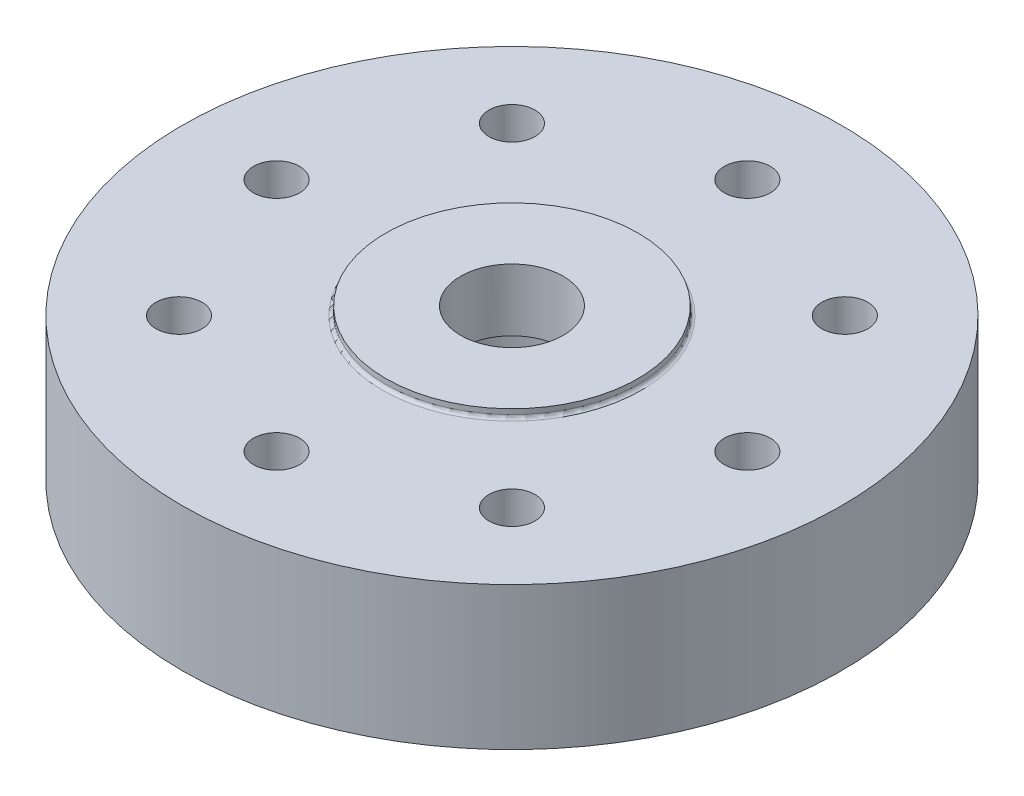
ISO-10303-21;
HEADER;
FILE_DESCRIPTION(('STEP AP214'),'2;1');
FILE_NAME('part.step','',(''),(''),'','','');
FILE_SCHEMA(('AUTOMOTIVE_DESIGN { 1 0 10303 214 1 1 1 1 }'));
ENDSEC;
DATA;
#1=APPLICATION_CONTEXT('core data for automotive mechanical design processes');
#2=APPLICATION_PROTOCOL_DEFINITION('international standard','automotive_design',2000,#1);
#3=PRODUCT_CONTEXT('',#1,'mechanical');
#4=PRODUCT('Part','Part','',(#3));
#5=PRODUCT_RELATED_PRODUCT_CATEGORY('part','',(#4));
#6=PRODUCT_DEFINITION_FORMATION('','',#4);
#7=PRODUCT_DEFINITION_CONTEXT('part definition',#1,'design');
#8=PRODUCT_DEFINITION('design','',#6,#7);
#9=PRODUCT_DEFINITION_SHAPE('','',#8);
#10=(LENGTH_UNIT() NAMED_UNIT(*) SI_UNIT(.MILLI.,.METRE.));
#11=(NAMED_UNIT(*) PLANE_ANGLE_UNIT() SI_UNIT($,.RADIAN.));
#12=(NAMED_UNIT(*) SI_UNIT($,.STERADIAN.) SOLID_ANGLE_UNIT());
#13=UNCERTAINTY_MEASURE_WITH_UNIT(LENGTH_MEASURE(1.E-05),#10,'distance_accuracy_value','');
#14=(GEOMETRIC_REPRESENTATION_CONTEXT(3) GLOBAL_UNCERTAINTY_ASSIGNED_CONTEXT((#13)) GLOBAL_UNIT_ASSIGNED_CONTEXT((#10,
#11,#12)) REPRESENTATION_CONTEXT('',''));
#15=CARTESIAN_POINT('',(0.,0.,0.));
#16=DIRECTION('',(0.,0.,1.));
#17=DIRECTION('',(1.,0.,0.));
#18=AXIS2_PLACEMENT_3D('',#15,#16,#17);
#19=CARTESIAN_POINT('',(0.,4.25,0.));
#20=DIRECTION('',(0.,1.,0.));
#21=DIRECTION('',(0.,0.,1.));
#22=AXIS2_PLACEMENT_3D('',#19,#20,#21);
#23=PLANE('',#22);
#24=CARTESIAN_POINT('',(0.,4.25,0.));
#25=DIRECTION('',(0.,1.,0.));
#26=DIRECTION('',(0.,0.,1.));
#27=AXIS2_PLACEMENT_3D('',#24,#25,#26);
#28=CIRCLE('',#27,3.85);
#29=CARTESIAN_POINT('',(0.,4.25,3.85));
#30=VERTEX_POINT('',#29);
#31=EDGE_CURVE('E11',#30,#30,#28,.F.);
#32=ORIENTED_EDGE('',*,*,#31,.T.);
#33=EDGE_LOOP('',(#32));
#34=FACE_BOUND('',#33,.T.);
#35=CARTESIAN_POINT('',(-4.94974746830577,4.25,-4.94974746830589));
#36=DIRECTION('',(0.,1.,0.));
#37=DIRECTION('',(0.,0.,1.));
#38=AXIS2_PLACEMENT_3D('',#35,#36,#37);
#39=CIRCLE('',#38,0.684999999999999);
#40=CARTESIAN_POINT('',(-4.94974746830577,4.25,-4.26474746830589));
#41=VERTEX_POINT('',#40);
#42=EDGE_CURVE('E310',#41,#41,#39,.T.);
#43=ORIENTED_EDGE('',*,*,#42,.F.);
#44=EDGE_LOOP('',(#43));
#45=FACE_BOUND('',#44,.T.);
#46=CARTESIAN_POINT('',(-4.94974746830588,4.25,4.94974746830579));
#47=DIRECTION('',(0.,1.,0.));
#48=DIRECTION('',(0.,0.,1.));
#49=AXIS2_PLACEMENT_3D('',#46,#47,#48);
#50=CIRCLE('',#49,0.685000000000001);
#51=CARTESIAN_POINT('',(-4.94974746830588,4.25,5.63474746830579));
#52=VERTEX_POINT('',#51);
#53=EDGE_CURVE('E326',#52,#52,#50,.T.);
#54=ORIENTED_EDGE('',*,*,#53,.F.);
#55=EDGE_LOOP('',(#54));
#56=FACE_BOUND('',#55,.T.);
#57=CARTESIAN_POINT('',(4.94974746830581,4.25,4.94974746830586));
#58=DIRECTION('',(0.,1.,0.));
#59=DIRECTION('',(0.,0.,1.));
#60=AXIS2_PLACEMENT_3D('',#57,#58,#59);
#61=CIRCLE('',#60,0.685);
#62=CARTESIAN_POINT('',(4.94974746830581,4.25,5.63474746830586));
#63=VERTEX_POINT('',#62);
#64=EDGE_CURVE('E342',#63,#63,#61,.T.);
#65=ORIENTED_EDGE('',*,*,#64,.F.);
#66=EDGE_LOOP('',(#65));
#67=FACE_BOUND('',#66,.T.);
#68=CARTESIAN_POINT('',(4.94974746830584,4.25,-4.94974746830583));
#69=DIRECTION('',(0.,1.,0.));
#70=DIRECTION('',(0.,0.,1.));
#71=AXIS2_PLACEMENT_3D('',#68,#69,#70);
#72=CIRCLE('',#71,0.685);
#73=CARTESIAN_POINT('',(4.94974746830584,4.25,-4.26474746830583));
#74=VERTEX_POINT('',#73);
#75=EDGE_CURVE('E358',#74,#74,#72,.T.);
#76=ORIENTED_EDGE('',*,*,#75,.F.);
#77=EDGE_LOOP('',(#76));
#78=FACE_BOUND('',#77,.T.);
#79=CARTESIAN_POINT('',(0.,4.25,-7.));
#80=DIRECTION('',(0.,1.,0.));
#81=DIRECTION('',(0.,0.,1.));
#82=AXIS2_PLACEMENT_3D('',#79,#80,#81);
#83=CIRCLE('',#82,0.685);
#84=CARTESIAN_POINT('',(0.,4.25,-6.315));
#85=VERTEX_POINT('',#84);
#86=EDGE_CURVE('E366',#85,#85,#83,.T.);
#87=ORIENTED_EDGE('',*,*,#86,.F.);
#88=EDGE_LOOP('',(#87));
#89=FACE_BOUND('',#88,.T.);
#90=CARTESIAN_POINT('',(0.,4.25,0.));
#91=DIRECTION('',(0.,1.,0.));
#92=DIRECTION('',(0.,0.,1.));
#93=AXIS2_PLACEMENT_3D('',#90,#91,#92);
#94=CIRCLE('',#93,9.8);
#95=CARTESIAN_POINT('',(0.,4.25,9.8));
#96=VERTEX_POINT('',#95);
#97=EDGE_CURVE('E374',#96,#96,#94,.T.);
#98=ORIENTED_EDGE('',*,*,#97,.T.);
#99=EDGE_LOOP('',(#98));
#100=FACE_BOUND('',#99,.T.);
#101=CARTESIAN_POINT('',(7.,4.25,0.));
#102=DIRECTION('',(0.,1.,0.));
#103=DIRECTION('',(0.,0.,1.));
#104=AXIS2_PLACEMENT_3D('',#101,#102,#103);
#105=CIRCLE('',#104,0.685);
#106=CARTESIAN_POINT('',(7.,4.25,0.685000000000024));
#107=VERTEX_POINT('',#106);
#108=EDGE_CURVE('E350',#107,#107,#105,.T.);
#109=ORIENTED_EDGE('',*,*,#108,.F.);
#110=EDGE_LOOP('',(#109));
#111=FACE_BOUND('',#110,.T.);
#112=CARTESIAN_POINT('',(0.,4.25,7.));
#113=DIRECTION('',(0.,1.,0.));
#114=DIRECTION('',(0.,0.,1.));
#115=AXIS2_PLACEMENT_3D('',#112,#113,#114);
#116=CIRCLE('',#115,0.685);
#117=CARTESIAN_POINT('',(0.,4.25,7.685));
#118=VERTEX_POINT('',#117);
#119=EDGE_CURVE('E334',#118,#118,#116,.T.);
#120=ORIENTED_EDGE('',*,*,#119,.F.);
#121=EDGE_LOOP('',(#120));
#122=FACE_BOUND('',#121,.T.);
#123=CARTESIAN_POINT('',(-7.,4.25,0.));
#124=DIRECTION('',(0.,1.,0.));
#125=DIRECTION('',(0.,0.,1.));
#126=AXIS2_PLACEMENT_3D('',#123,#124,#125);
#127=CIRCLE('',#126,0.685);
#128=CARTESIAN_POINT('',(-7.,4.25,0.684999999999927));
#129=VERTEX_POINT('',#128);
#130=EDGE_CURVE('E318',#129,#129,#127,.T.);
#131=ORIENTED_EDGE('',*,*,#130,.F.);
#132=EDGE_LOOP('',(#131));
#133=FACE_BOUND('',#132,.T.);
#134=ADVANCED_FACE('F45',(#34,#45,#56,#67,#78,#89,#100,#111,#122,#133),#23,.T.);
#135=CARTESIAN_POINT('',(0.,4.25,0.));
#136=DIRECTION('',(0.,-1.,0.));
#137=DIRECTION('',(0.,0.,-1.));
#138=AXIS2_PLACEMENT_3D('',#135,#136,#137);
#139=CYLINDRICAL_SURFACE('',#138,1.525);
#140=CARTESIAN_POINT('',(0.,2.65,0.));
#141=DIRECTION('',(0.,-1.,0.));
#142=DIRECTION('',(0.,0.,-1.));
#143=AXIS2_PLACEMENT_3D('',#140,#141,#142);
#144=CIRCLE('',#143,1.525);
#145=CARTESIAN_POINT('',(0.,2.65,-1.525));
#146=VERTEX_POINT('',#145);
#147=EDGE_CURVE('E381',#146,#146,#144,.T.);
#148=ORIENTED_EDGE('',*,*,#147,.T.);
#149=EDGE_LOOP('',(#148));
#150=FACE_BOUND('',#149,.T.);
#151=CARTESIAN_POINT('',(0.,4.5,0.));
#152=DIRECTION('',(0.,1.,0.));
#153=DIRECTION('',(0.,0.,1.));
#154=AXIS2_PLACEMENT_3D('',#151,#152,#153);
#155=CIRCLE('',#154,1.525);
#156=CARTESIAN_POINT('',(0.,4.5,1.525));
#157=VERTEX_POINT('',#156);
#158=EDGE_CURVE('E857',#157,#157,#155,.T.);
#159=ORIENTED_EDGE('',*,*,#158,.T.);
#160=EDGE_LOOP('',(#159));
#161=FACE_BOUND('',#160,.T.);
#162=ADVANCED_FACE('F402',(#150,#161),#139,.F.);
#163=CARTESIAN_POINT('',(0.,0.,0.));
#164=DIRECTION('',(0.,1.,0.));
#165=DIRECTION('',(0.,0.,1.));
#166=AXIS2_PLACEMENT_3D('',#163,#164,#165);
#167=PLANE('',#166);
#168=CARTESIAN_POINT('',(4.94974746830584,0.,-4.94974746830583));
#169=DIRECTION('',(0.,1.,0.));
#170=DIRECTION('',(0.,0.,1.));
#171=AXIS2_PLACEMENT_3D('',#168,#169,#170);
#172=CIRCLE('',#171,1.885);
#173=CARTESIAN_POINT('',(5.25146114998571,0.,-6.81044461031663));
#174=VERTEX_POINT('',#173);
#175=CARTESIAN_POINT('',(6.81044461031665,0.,-5.25146114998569));
#176=VERTEX_POINT('',#175);
#177=EDGE_CURVE('E249',#174,#176,#172,.T.);
#178=ORIENTED_EDGE('',*,*,#177,.F.);
#179=CARTESIAN_POINT('',(0.,0.,0.));
#180=DIRECTION('',(0.,1.,0.));
#181=DIRECTION('',(0.,0.,1.));
#182=AXIS2_PLACEMENT_3D('',#179,#180,#181);
#183=CIRCLE('',#182,8.6);
#184=CARTESIAN_POINT('',(1.10236777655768,0.,-8.52905535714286));
#185=VERTEX_POINT('',#184);
#186=EDGE_CURVE('E203',#174,#185,#183,.T.);
#187=ORIENTED_EDGE('',*,*,#186,.T.);
#188=CARTESIAN_POINT('',(0.,0.,-7.));
#189=DIRECTION('',(0.,1.,0.));
#190=DIRECTION('',(0.,0.,1.));
#191=AXIS2_PLACEMENT_3D('',#188,#189,#190);
#192=CIRCLE('',#191,1.885);
#193=CARTESIAN_POINT('',(-1.10236777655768,0.,-8.52905535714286));
#194=VERTEX_POINT('',#193);
#195=EDGE_CURVE('E244',#194,#185,#192,.T.);
#196=ORIENTED_EDGE('',*,*,#195,.F.);
#197=CARTESIAN_POINT('',(-5.25146114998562,0.,-6.8104446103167));
#198=VERTEX_POINT('',#197);
#199=EDGE_CURVE('E61',#194,#198,#183,.T.);
#200=ORIENTED_EDGE('',*,*,#199,.T.);
#201=CARTESIAN_POINT('',(-4.94974746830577,0.,-4.94974746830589));
#202=DIRECTION('',(0.,1.,0.));
#203=DIRECTION('',(0.,0.,1.));
#204=AXIS2_PLACEMENT_3D('',#201,#202,#203);
#205=CIRCLE('',#204,1.885);
#206=CARTESIAN_POINT('',(-6.81044461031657,0.,-5.25146114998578));
#207=VERTEX_POINT('',#206);
#208=EDGE_CURVE('E230',#207,#198,#205,.T.);
#209=ORIENTED_EDGE('',*,*,#208,.F.);
#210=CARTESIAN_POINT('',(-8.52905535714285,0.,-1.10236777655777));
#211=VERTEX_POINT('',#210);
#212=EDGE_CURVE('E897',#207,#211,#183,.T.);
#213=ORIENTED_EDGE('',*,*,#212,.T.);
#214=CARTESIAN_POINT('',(-7.,0.,0.));
#215=DIRECTION('',(0.,1.,0.));
#216=DIRECTION('',(0.,0.,1.));
#217=AXIS2_PLACEMENT_3D('',#214,#215,#216);
#218=CIRCLE('',#217,1.885);
#219=CARTESIAN_POINT('',(-8.52905535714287,0.,1.10236777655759));
#220=VERTEX_POINT('',#219);
#221=EDGE_CURVE('E180',#220,#211,#218,.T.);
#222=ORIENTED_EDGE('',*,*,#221,.F.);
#223=CARTESIAN_POINT('',(-6.81044461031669,0.,5.25146114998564));
#224=VERTEX_POINT('',#223);
#225=EDGE_CURVE('E164',#220,#224,#183,.T.);
#226=ORIENTED_EDGE('',*,*,#225,.T.);
#227=CARTESIAN_POINT('',(-4.94974746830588,0.,4.94974746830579));
#228=DIRECTION('',(0.,1.,0.));
#229=DIRECTION('',(0.,0.,1.));
#230=AXIS2_PLACEMENT_3D('',#227,#228,#229);
#231=CIRCLE('',#230,1.885);
#232=CARTESIAN_POINT('',(-5.25146114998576,0.,6.81044461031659));
#233=VERTEX_POINT('',#232);
#234=EDGE_CURVE('E179',#233,#224,#231,.T.);
#235=ORIENTED_EDGE('',*,*,#234,.F.);
#236=CARTESIAN_POINT('',(-1.10236777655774,0.,8.52905535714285));
#237=VERTEX_POINT('',#236);
#238=EDGE_CURVE('E904',#233,#237,#183,.T.);
#239=ORIENTED_EDGE('',*,*,#238,.T.);
#240=CARTESIAN_POINT('',(0.,0.,7.));
#241=DIRECTION('',(0.,1.,0.));
#242=DIRECTION('',(0.,0.,1.));
#243=AXIS2_PLACEMENT_3D('',#240,#241,#242);
#244=CIRCLE('',#243,1.885);
#245=CARTESIAN_POINT('',(1.10236777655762,0.,8.52905535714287));
#246=VERTEX_POINT('',#245);
#247=EDGE_CURVE('E264',#246,#237,#244,.T.);
#248=ORIENTED_EDGE('',*,*,#247,.F.);
#249=CARTESIAN_POINT('',(5.25146114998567,0.,6.81044461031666));
#250=VERTEX_POINT('',#249);
#251=EDGE_CURVE('E908',#246,#250,#183,.T.);
#252=ORIENTED_EDGE('',*,*,#251,.T.);
#253=CARTESIAN_POINT('',(4.94974746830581,0.,4.94974746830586));
#254=DIRECTION('',(0.,1.,0.));
#255=DIRECTION('',(0.,0.,1.));
#256=AXIS2_PLACEMENT_3D('',#253,#254,#255);
#257=CIRCLE('',#256,1.885);
#258=CARTESIAN_POINT('',(6.81044461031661,0.,5.25146114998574));
#259=VERTEX_POINT('',#258);
#260=EDGE_CURVE('E259',#259,#250,#257,.T.);
#261=ORIENTED_EDGE('',*,*,#260,.F.);
#262=CARTESIAN_POINT('',(8.52905535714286,0.,1.10236777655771));
#263=VERTEX_POINT('',#262);
#264=EDGE_CURVE('E890',#259,#263,#183,.T.);
#265=ORIENTED_EDGE('',*,*,#264,.T.);
#266=CARTESIAN_POINT('',(7.,0.,0.));
#267=DIRECTION('',(0.,1.,0.));
#268=DIRECTION('',(0.,0.,1.));
#269=AXIS2_PLACEMENT_3D('',#266,#267,#268);
#270=CIRCLE('',#269,1.885);
#271=CARTESIAN_POINT('',(8.52905535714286,0.,-1.10236777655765));
#272=VERTEX_POINT('',#271);
#273=EDGE_CURVE('E254',#272,#263,#270,.T.);
#274=ORIENTED_EDGE('',*,*,#273,.F.);
#275=EDGE_CURVE('E243',#272,#176,#183,.T.);
#276=ORIENTED_EDGE('',*,*,#275,.T.);
#277=EDGE_LOOP('',(#178,#187,#196,#200,#209,#213,#222,#226,#235,#239,#248,#252,#261,#265,#274,#276));
#278=FACE_BOUND('',#277,.T.);
#279=CARTESIAN_POINT('',(0.,0.,0.));
#280=DIRECTION('',(0.,1.,0.));
#281=DIRECTION('',(0.,0.,1.));
#282=AXIS2_PLACEMENT_3D('',#279,#280,#281);
#283=CIRCLE('',#282,9.8);
#284=CARTESIAN_POINT('',(0.,0.,9.8));
#285=VERTEX_POINT('',#284);
#286=EDGE_CURVE('E370',#285,#285,#283,.T.);
#287=ORIENTED_EDGE('',*,*,#286,.F.);
#288=EDGE_LOOP('',(#287));
#289=FACE_BOUND('',#288,.T.);
#290=CARTESIAN_POINT('',(0.,0.,-7.));
#291=DIRECTION('',(0.,1.,0.));
#292=DIRECTION('',(0.,0.,1.));
#293=AXIS2_PLACEMENT_3D('',#290,#291,#292);
#294=CIRCLE('',#293,0.685);
#295=CARTESIAN_POINT('',(0.,0.,-6.315));
#296=VERTEX_POINT('',#295);
#297=EDGE_CURVE('E362',#296,#296,#294,.T.);
#298=ORIENTED_EDGE('',*,*,#297,.T.);
#299=EDGE_LOOP('',(#298));
#300=FACE_BOUND('',#299,.T.);
#301=CARTESIAN_POINT('',(4.94974746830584,0.,-4.94974746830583));
#302=DIRECTION('',(0.,1.,0.));
#303=DIRECTION('',(0.,0.,1.));
#304=AXIS2_PLACEMENT_3D('',#301,#302,#303);
#305=CIRCLE('',#304,0.685);
#306=CARTESIAN_POINT('',(4.94974746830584,0.,-4.26474746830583));
#307=VERTEX_POINT('',#306);
#308=EDGE_CURVE('E354',#307,#307,#305,.T.);
#309=ORIENTED_EDGE('',*,*,#308,.T.);
#310=EDGE_LOOP('',(#309));
#311=FACE_BOUND('',#310,.T.);
#312=CARTESIAN_POINT('',(7.,0.,0.));
#313=DIRECTION('',(0.,1.,0.));
#314=DIRECTION('',(0.,0.,1.));
#315=AXIS2_PLACEMENT_3D('',#312,#313,#314);
#316=CIRCLE('',#315,0.685);
#317=CARTESIAN_POINT('',(7.,0.,0.685000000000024));
#318=VERTEX_POINT('',#317);
#319=EDGE_CURVE('E346',#318,#318,#316,.T.);
#320=ORIENTED_EDGE('',*,*,#319,.T.);
#321=EDGE_LOOP('',(#320));
#322=FACE_BOUND('',#321,.T.);
#323=CARTESIAN_POINT('',(4.94974746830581,0.,4.94974746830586));
#324=DIRECTION('',(0.,1.,0.));
#325=DIRECTION('',(0.,0.,1.));
#326=AXIS2_PLACEMENT_3D('',#323,#324,#325);
#327=CIRCLE('',#326,0.685);
#328=CARTESIAN_POINT('',(4.94974746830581,0.,5.63474746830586));
#329=VERTEX_POINT('',#328);
#330=EDGE_CURVE('E338',#329,#329,#327,.T.);
#331=ORIENTED_EDGE('',*,*,#330,.T.);
#332=EDGE_LOOP('',(#331));
#333=FACE_BOUND('',#332,.T.);
#334=CARTESIAN_POINT('',(0.,0.,7.));
#335=DIRECTION('',(0.,1.,0.));
#336=DIRECTION('',(0.,0.,1.));
#337=AXIS2_PLACEMENT_3D('',#334,#335,#336);
#338=CIRCLE('',#337,0.685);
#339=CARTESIAN_POINT('',(0.,0.,7.685));
#340=VERTEX_POINT('',#339);
#341=EDGE_CURVE('E330',#340,#340,#338,.T.);
#342=ORIENTED_EDGE('',*,*,#341,.T.);
#343=EDGE_LOOP('',(#342));
#344=FACE_BOUND('',#343,.T.);
#345=CARTESIAN_POINT('',(-4.94974746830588,0.,4.94974746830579));
#346=DIRECTION('',(0.,1.,0.));
#347=DIRECTION('',(0.,0.,1.));
#348=AXIS2_PLACEMENT_3D('',#345,#346,#347);
#349=CIRCLE('',#348,0.685000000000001);
#350=CARTESIAN_POINT('',(-4.94974746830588,0.,5.63474746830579));
#351=VERTEX_POINT('',#350);
#352=EDGE_CURVE('E322',#351,#351,#349,.T.);
#353=ORIENTED_EDGE('',*,*,#352,.T.);
#354=EDGE_LOOP('',(#353));
#355=FACE_BOUND('',#354,.T.);
#356=CARTESIAN_POINT('',(-7.,0.,0.));
#357=DIRECTION('',(0.,1.,0.));
#358=DIRECTION('',(0.,0.,1.));
#359=AXIS2_PLACEMENT_3D('',#356,#357,#358);
#360=CIRCLE('',#359,0.685);
#361=CARTESIAN_POINT('',(-7.,0.,0.684999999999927));
#362=VERTEX_POINT('',#361);
#363=EDGE_CURVE('E314',#362,#362,#360,.T.);
#364=ORIENTED_EDGE('',*,*,#363,.T.);
#365=EDGE_LOOP('',(#364));
#366=FACE_BOUND('',#365,.T.);
#367=CARTESIAN_POINT('',(-4.94974746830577,0.,-4.94974746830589));
#368=DIRECTION('',(0.,1.,0.));
#369=DIRECTION('',(0.,0.,1.));
#370=AXIS2_PLACEMENT_3D('',#367,#368,#369);
#371=CIRCLE('',#370,0.684999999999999);
#372=CARTESIAN_POINT('',(-4.94974746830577,0.,-4.26474746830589));
#373=VERTEX_POINT('',#372);
#374=EDGE_CURVE('E309',#373,#373,#371,.T.);
#375=ORIENTED_EDGE('',*,*,#374,.T.);
#376=EDGE_LOOP('',(#375));
#377=FACE_BOUND('',#376,.T.);
#378=ADVANCED_FACE('F408',(#278,#289,#300,#311,#322,#333,#344,#355,#366,#377),#167,.F.);
#379=CARTESIAN_POINT('',(0.,4.25,0.));
#380=DIRECTION('',(0.,-1.,0.));
#381=DIRECTION('',(0.,0.,-1.));
#382=AXIS2_PLACEMENT_3D('',#379,#380,#381);
#383=CYLINDRICAL_SURFACE('',#382,9.8);
#384=ORIENTED_EDGE('',*,*,#97,.F.);
#385=EDGE_LOOP('',(#384));
#386=FACE_BOUND('',#385,.T.);
#387=ORIENTED_EDGE('',*,*,#286,.T.);
#388=EDGE_LOOP('',(#387));
#389=FACE_BOUND('',#388,.T.);
#390=ADVANCED_FACE('F416',(#386,#389),#383,.T.);
#391=CARTESIAN_POINT('',(0.,4.25,-7.));
#392=DIRECTION('',(0.,-1.,0.));
#393=DIRECTION('',(0.,0.,-1.));
#394=AXIS2_PLACEMENT_3D('',#391,#392,#393);
#395=CYLINDRICAL_SURFACE('',#394,0.685);
#396=ORIENTED_EDGE('',*,*,#86,.T.);
#397=EDGE_LOOP('',(#396));
#398=FACE_BOUND('',#397,.T.);
#399=ORIENTED_EDGE('',*,*,#297,.F.);
#400=EDGE_LOOP('',(#399));
#401=FACE_BOUND('',#400,.T.);
#402=ADVANCED_FACE('F414',(#398,#401),#395,.F.);
#403=CARTESIAN_POINT('',(4.94974746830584,4.25,-4.94974746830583));
#404=DIRECTION('',(0.,-1.,0.));
#405=DIRECTION('',(0.,0.,-1.));
#406=AXIS2_PLACEMENT_3D('',#403,#404,#405);
#407=CYLINDRICAL_SURFACE('',#406,0.685);
#408=ORIENTED_EDGE('',*,*,#75,.T.);
#409=EDGE_LOOP('',(#408));
#410=FACE_BOUND('',#409,.T.);
#411=ORIENTED_EDGE('',*,*,#308,.F.);
#412=EDGE_LOOP('',(#411));
#413=FACE_BOUND('',#412,.T.);
#414=ADVANCED_FACE('F423',(#410,#413),#407,.F.);
#415=CARTESIAN_POINT('',(7.,4.25,0.));
#416=DIRECTION('',(0.,-1.,0.));
#417=DIRECTION('',(0.,0.,-1.));
#418=AXIS2_PLACEMENT_3D('',#415,#416,#417);
#419=CYLINDRICAL_SURFACE('',#418,0.685);
#420=ORIENTED_EDGE('',*,*,#108,.T.);
#421=EDGE_LOOP('',(#420));
#422=FACE_BOUND('',#421,.T.);
#423=ORIENTED_EDGE('',*,*,#319,.F.);
#424=EDGE_LOOP('',(#423));
#425=FACE_BOUND('',#424,.T.);
#426=ADVANCED_FACE('F476',(#422,#425),#419,.F.);
#427=CARTESIAN_POINT('',(4.94974746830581,4.25,4.94974746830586));
#428=DIRECTION('',(0.,-1.,0.));
#429=DIRECTION('',(0.,0.,-1.));
#430=AXIS2_PLACEMENT_3D('',#427,#428,#429);
#431=CYLINDRICAL_SURFACE('',#430,0.685);
#432=ORIENTED_EDGE('',*,*,#64,.T.);
#433=EDGE_LOOP('',(#432));
#434=FACE_BOUND('',#433,.T.);
#435=ORIENTED_EDGE('',*,*,#330,.F.);
#436=EDGE_LOOP('',(#435));
#437=FACE_BOUND('',#436,.T.);
#438=ADVANCED_FACE('F472',(#434,#437),#431,.F.);
#439=CARTESIAN_POINT('',(0.,4.25,7.));
#440=DIRECTION('',(0.,-1.,0.));
#441=DIRECTION('',(0.,0.,-1.));
#442=AXIS2_PLACEMENT_3D('',#439,#440,#441);
#443=CYLINDRICAL_SURFACE('',#442,0.685);
#444=ORIENTED_EDGE('',*,*,#119,.T.);
#445=EDGE_LOOP('',(#444));
#446=FACE_BOUND('',#445,.T.);
#447=ORIENTED_EDGE('',*,*,#341,.F.);
#448=EDGE_LOOP('',(#447));
#449=FACE_BOUND('',#448,.T.);
#450=ADVANCED_FACE('F468',(#446,#449),#443,.F.);
#451=CARTESIAN_POINT('',(-4.94974746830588,4.25,4.94974746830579));
#452=DIRECTION('',(0.,-1.,0.));
#453=DIRECTION('',(0.,0.,-1.));
#454=AXIS2_PLACEMENT_3D('',#451,#452,#453);
#455=CYLINDRICAL_SURFACE('',#454,0.685000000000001);
#456=ORIENTED_EDGE('',*,*,#53,.T.);
#457=EDGE_LOOP('',(#456));
#458=FACE_BOUND('',#457,.T.);
#459=ORIENTED_EDGE('',*,*,#352,.F.);
#460=EDGE_LOOP('',(#459));
#461=FACE_BOUND('',#460,.T.);
#462=ADVANCED_FACE('F459',(#458,#461),#455,.F.);
#463=CARTESIAN_POINT('',(-7.,4.25,0.));
#464=DIRECTION('',(0.,-1.,0.));
#465=DIRECTION('',(0.,0.,-1.));
#466=AXIS2_PLACEMENT_3D('',#463,#464,#465);
#467=CYLINDRICAL_SURFACE('',#466,0.685);
#468=ORIENTED_EDGE('',*,*,#130,.T.);
#469=EDGE_LOOP('',(#468));
#470=FACE_BOUND('',#469,.T.);
#471=ORIENTED_EDGE('',*,*,#363,.F.);
#472=EDGE_LOOP('',(#471));
#473=FACE_BOUND('',#472,.T.);
#474=ADVANCED_FACE('F449',(#470,#473),#467,.F.);
#475=CARTESIAN_POINT('',(-4.94974746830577,4.25,-4.94974746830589));
#476=DIRECTION('',(0.,-1.,0.));
#477=DIRECTION('',(0.,0.,-1.));
#478=AXIS2_PLACEMENT_3D('',#475,#476,#477);
#479=CYLINDRICAL_SURFACE('',#478,0.684999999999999);
#480=ORIENTED_EDGE('',*,*,#42,.T.);
#481=EDGE_LOOP('',(#480));
#482=FACE_BOUND('',#481,.T.);
#483=ORIENTED_EDGE('',*,*,#374,.F.);
#484=EDGE_LOOP('',(#483));
#485=FACE_BOUND('',#484,.T.);
#486=ADVANCED_FACE('F446',(#482,#485),#479,.F.);
#487=CARTESIAN_POINT('',(0.,4.25,0.));
#488=DIRECTION('',(0.,-1.,0.));
#489=DIRECTION('',(0.,0.,-1.));
#490=AXIS2_PLACEMENT_3D('',#487,#488,#489);
#491=CYLINDRICAL_SURFACE('',#490,8.6);
#492=DIRECTION('',(0.,-1.,0.));
#493=VECTOR('',#492,1.);
#494=CARTESIAN_POINT('',(1.10236777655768,4.25,-8.52905535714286));
#495=LINE('',#494,#493);
#496=CARTESIAN_POINT('',(1.10236777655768,3.05,-8.52905535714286));
#497=VERTEX_POINT('',#496);
#498=EDGE_CURVE('E306',#497,#185,#495,.T.);
#499=ORIENTED_EDGE('',*,*,#498,.T.);
#500=ORIENTED_EDGE('',*,*,#186,.F.);
#501=DIRECTION('',(0.,-1.,0.));
#502=VECTOR('',#501,1.);
#503=CARTESIAN_POINT('',(5.25146114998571,4.25,-6.81044461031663));
#504=LINE('',#503,#502);
#505=CARTESIAN_POINT('',(5.25146114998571,3.05,-6.81044461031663));
#506=VERTEX_POINT('',#505);
#507=EDGE_CURVE('E301',#506,#174,#504,.T.);
#508=ORIENTED_EDGE('',*,*,#507,.F.);
#509=CARTESIAN_POINT('',(0.,3.05,0.));
#510=DIRECTION('',(0.,1.,0.));
#511=DIRECTION('',(0.,0.,1.));
#512=AXIS2_PLACEMENT_3D('',#509,#510,#511);
#513=CIRCLE('',#512,8.6);
#514=EDGE_CURVE('E211',#506,#497,#513,.T.);
#515=ORIENTED_EDGE('',*,*,#514,.T.);
#516=EDGE_LOOP('',(#499,#500,#508,#515));
#517=FACE_BOUND('',#516,.T.);
#518=ADVANCED_FACE('F448',(#517),#491,.F.);
#519=CARTESIAN_POINT('',(-1.10236777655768,3.05,-8.52905535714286));
#520=VERTEX_POINT('',#519);
#521=CARTESIAN_POINT('',(-5.25146114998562,3.05,-6.8104446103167));
#522=VERTEX_POINT('',#521);
#523=EDGE_CURVE('E202',#520,#522,#513,.T.);
#524=ORIENTED_EDGE('',*,*,#523,.T.);
#525=DIRECTION('',(0.,-1.,0.));
#526=VECTOR('',#525,1.);
#527=CARTESIAN_POINT('',(-5.25146114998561,4.25,-6.8104446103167));
#528=LINE('',#527,#526);
#529=EDGE_CURVE('E66',#522,#198,#528,.T.);
#530=ORIENTED_EDGE('',*,*,#529,.T.);
#531=ORIENTED_EDGE('',*,*,#199,.F.);
#532=DIRECTION('',(0.,-1.,0.));
#533=VECTOR('',#532,1.);
#534=CARTESIAN_POINT('',(-1.10236777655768,4.25,-8.52905535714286));
#535=LINE('',#534,#533);
#536=EDGE_CURVE('E220',#520,#194,#535,.T.);
#537=ORIENTED_EDGE('',*,*,#536,.F.);
#538=EDGE_LOOP('',(#524,#530,#531,#537));
#539=FACE_BOUND('',#538,.T.);
#540=ADVANCED_FACE('F219',(#539),#491,.F.);
#541=DIRECTION('',(0.,-1.,0.));
#542=VECTOR('',#541,1.);
#543=CARTESIAN_POINT('',(6.81044461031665,4.25,-5.25146114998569));
#544=LINE('',#543,#542);
#545=CARTESIAN_POINT('',(6.81044461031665,3.05,-5.25146114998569));
#546=VERTEX_POINT('',#545);
#547=EDGE_CURVE('E298',#546,#176,#544,.T.);
#548=ORIENTED_EDGE('',*,*,#547,.T.);
#549=ORIENTED_EDGE('',*,*,#275,.F.);
#550=DIRECTION('',(0.,-1.,0.));
#551=VECTOR('',#550,1.);
#552=CARTESIAN_POINT('',(8.52905535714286,4.25,-1.10236777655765));
#553=LINE('',#552,#551);
#554=CARTESIAN_POINT('',(8.52905535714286,3.05,-1.10236777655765));
#555=VERTEX_POINT('',#554);
#556=EDGE_CURVE('E295',#555,#272,#553,.T.);
#557=ORIENTED_EDGE('',*,*,#556,.F.);
#558=EDGE_CURVE('E206',#555,#546,#513,.T.);
#559=ORIENTED_EDGE('',*,*,#558,.T.);
#560=EDGE_LOOP('',(#548,#549,#557,#559));
#561=FACE_BOUND('',#560,.T.);
#562=ADVANCED_FACE('F555',(#561),#491,.F.);
#563=DIRECTION('',(0.,-1.,0.));
#564=VECTOR('',#563,1.);
#565=CARTESIAN_POINT('',(8.52905535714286,4.25,1.10236777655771));
#566=LINE('',#565,#564);
#567=CARTESIAN_POINT('',(8.52905535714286,3.05,1.10236777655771));
#568=VERTEX_POINT('',#567);
#569=EDGE_CURVE('E292',#568,#263,#566,.T.);
#570=ORIENTED_EDGE('',*,*,#569,.T.);
#571=ORIENTED_EDGE('',*,*,#264,.F.);
#572=DIRECTION('',(0.,-1.,0.));
#573=VECTOR('',#572,1.);
#574=CARTESIAN_POINT('',(6.81044461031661,4.25,5.25146114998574));
#575=LINE('',#574,#573);
#576=CARTESIAN_POINT('',(6.81044461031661,3.05,5.25146114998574));
#577=VERTEX_POINT('',#576);
#578=EDGE_CURVE('E289',#577,#259,#575,.T.);
#579=ORIENTED_EDGE('',*,*,#578,.F.);
#580=EDGE_CURVE('E198',#577,#568,#513,.T.);
#581=ORIENTED_EDGE('',*,*,#580,.T.);
#582=EDGE_LOOP('',(#570,#571,#579,#581));
#583=FACE_BOUND('',#582,.T.);
#584=ADVANCED_FACE('F564',(#583),#491,.F.);
#585=DIRECTION('',(0.,-1.,0.));
#586=VECTOR('',#585,1.);
#587=CARTESIAN_POINT('',(5.25146114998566,4.25,6.81044461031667));
#588=LINE('',#587,#586);
#589=CARTESIAN_POINT('',(5.25146114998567,3.05,6.81044461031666));
#590=VERTEX_POINT('',#589);
#591=EDGE_CURVE('E286',#590,#250,#588,.T.);
#592=ORIENTED_EDGE('',*,*,#591,.T.);
#593=ORIENTED_EDGE('',*,*,#251,.F.);
#594=DIRECTION('',(0.,-1.,0.));
#595=VECTOR('',#594,1.);
#596=CARTESIAN_POINT('',(1.10236777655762,4.25,8.52905535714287));
#597=LINE('',#596,#595);
#598=CARTESIAN_POINT('',(1.10236777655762,3.05,8.52905535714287));
#599=VERTEX_POINT('',#598);
#600=EDGE_CURVE('E283',#599,#246,#597,.T.);
#601=ORIENTED_EDGE('',*,*,#600,.F.);
#602=EDGE_CURVE('E192',#599,#590,#513,.T.);
#603=ORIENTED_EDGE('',*,*,#602,.T.);
#604=EDGE_LOOP('',(#592,#593,#601,#603));
#605=FACE_BOUND('',#604,.T.);
#606=ADVANCED_FACE('F573',(#605),#491,.F.);
#607=DIRECTION('',(0.,-1.,0.));
#608=VECTOR('',#607,1.);
#609=CARTESIAN_POINT('',(-1.10236777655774,4.25,8.52905535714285));
#610=LINE('',#609,#608);
#611=CARTESIAN_POINT('',(-1.10236777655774,3.05,8.52905535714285));
#612=VERTEX_POINT('',#611);
#613=EDGE_CURVE('E280',#612,#237,#610,.T.);
#614=ORIENTED_EDGE('',*,*,#613,.T.);
#615=ORIENTED_EDGE('',*,*,#238,.F.);
#616=DIRECTION('',(0.,-1.,0.));
#617=VECTOR('',#616,1.);
#618=CARTESIAN_POINT('',(-5.25146114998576,4.25,6.8104446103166));
#619=LINE('',#618,#617);
#620=CARTESIAN_POINT('',(-5.25146114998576,3.05,6.81044461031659));
#621=VERTEX_POINT('',#620);
#622=EDGE_CURVE('E277',#621,#233,#619,.T.);
#623=ORIENTED_EDGE('',*,*,#622,.F.);
#624=EDGE_CURVE('E189',#621,#612,#513,.T.);
#625=ORIENTED_EDGE('',*,*,#624,.T.);
#626=EDGE_LOOP('',(#614,#615,#623,#625));
#627=FACE_BOUND('',#626,.T.);
#628=ADVANCED_FACE('F583',(#627),#491,.F.);
#629=DIRECTION('',(0.,-1.,0.));
#630=VECTOR('',#629,1.);
#631=CARTESIAN_POINT('',(-6.81044461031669,4.25,5.25146114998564));
#632=LINE('',#631,#630);
#633=CARTESIAN_POINT('',(-6.81044461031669,3.05,5.25146114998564));
#634=VERTEX_POINT('',#633);
#635=EDGE_CURVE('E169',#634,#224,#632,.T.);
#636=ORIENTED_EDGE('',*,*,#635,.T.);
#637=ORIENTED_EDGE('',*,*,#225,.F.);
#638=DIRECTION('',(0.,-1.,0.));
#639=VECTOR('',#638,1.);
#640=CARTESIAN_POINT('',(-8.52905535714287,4.25,1.10236777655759));
#641=LINE('',#640,#639);
#642=CARTESIAN_POINT('',(-8.52905535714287,3.05,1.10236777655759));
#643=VERTEX_POINT('',#642);
#644=EDGE_CURVE('E158',#643,#220,#641,.T.);
#645=ORIENTED_EDGE('',*,*,#644,.F.);
#646=EDGE_CURVE('E162',#643,#634,#513,.T.);
#647=ORIENTED_EDGE('',*,*,#646,.T.);
#648=EDGE_LOOP('',(#636,#637,#645,#647));
#649=FACE_BOUND('',#648,.T.);
#650=ADVANCED_FACE('F160',(#649),#491,.F.);
#651=CARTESIAN_POINT('',(0.,3.05,0.));
#652=DIRECTION('',(0.,1.,0.));
#653=DIRECTION('',(0.,0.,1.));
#654=AXIS2_PLACEMENT_3D('',#651,#652,#653);
#655=PLANE('',#654);
#656=CARTESIAN_POINT('',(0.,3.05,0.));
#657=DIRECTION('',(0.,1.,0.));
#658=DIRECTION('',(0.,0.,1.));
#659=AXIS2_PLACEMENT_3D('',#656,#657,#658);
#660=CIRCLE('',#659,4.4);
#661=CARTESIAN_POINT('',(0.,3.05,-4.4));
#662=VERTEX_POINT('',#661);
#663=EDGE_CURVE('E235',#662,#662,#660,.F.);
#664=ORIENTED_EDGE('',*,*,#663,.F.);
#665=EDGE_LOOP('',(#664));
#666=FACE_BOUND('',#665,.T.);
#667=ORIENTED_EDGE('',*,*,#523,.F.);
#668=CARTESIAN_POINT('',(0.,3.05,-7.));
#669=DIRECTION('',(0.,1.,0.));
#670=DIRECTION('',(0.,0.,1.));
#671=AXIS2_PLACEMENT_3D('',#668,#669,#670);
#672=CIRCLE('',#671,1.885);
#673=EDGE_CURVE('E225',#520,#497,#672,.T.);
#674=ORIENTED_EDGE('',*,*,#673,.T.);
#675=ORIENTED_EDGE('',*,*,#514,.F.);
#676=CARTESIAN_POINT('',(4.94974746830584,3.05,-4.94974746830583));
#677=DIRECTION('',(0.,1.,0.));
#678=DIRECTION('',(0.,0.,1.));
#679=AXIS2_PLACEMENT_3D('',#676,#677,#678);
#680=CIRCLE('',#679,1.885);
#681=EDGE_CURVE('E248',#506,#546,#680,.T.);
#682=ORIENTED_EDGE('',*,*,#681,.T.);
#683=ORIENTED_EDGE('',*,*,#558,.F.);
#684=CARTESIAN_POINT('',(7.,3.05,0.));
#685=DIRECTION('',(0.,1.,0.));
#686=DIRECTION('',(0.,0.,1.));
#687=AXIS2_PLACEMENT_3D('',#684,#685,#686);
#688=CIRCLE('',#687,1.885);
#689=EDGE_CURVE('E253',#555,#568,#688,.T.);
#690=ORIENTED_EDGE('',*,*,#689,.T.);
#691=ORIENTED_EDGE('',*,*,#580,.F.);
#692=CARTESIAN_POINT('',(4.94974746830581,3.05,4.94974746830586));
#693=DIRECTION('',(0.,1.,0.));
#694=DIRECTION('',(0.,0.,1.));
#695=AXIS2_PLACEMENT_3D('',#692,#693,#694);
#696=CIRCLE('',#695,1.885);
#697=EDGE_CURVE('E258',#577,#590,#696,.T.);
#698=ORIENTED_EDGE('',*,*,#697,.T.);
#699=ORIENTED_EDGE('',*,*,#602,.F.);
#700=CARTESIAN_POINT('',(0.,3.05,7.));
#701=DIRECTION('',(0.,1.,0.));
#702=DIRECTION('',(0.,0.,1.));
#703=AXIS2_PLACEMENT_3D('',#700,#701,#702);
#704=CIRCLE('',#703,1.885);
#705=EDGE_CURVE('E263',#599,#612,#704,.T.);
#706=ORIENTED_EDGE('',*,*,#705,.T.);
#707=ORIENTED_EDGE('',*,*,#624,.F.);
#708=CARTESIAN_POINT('',(-4.94974746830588,3.05,4.94974746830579));
#709=DIRECTION('',(0.,1.,0.));
#710=DIRECTION('',(0.,0.,1.));
#711=AXIS2_PLACEMENT_3D('',#708,#709,#710);
#712=CIRCLE('',#711,1.885);
#713=EDGE_CURVE('E187',#621,#634,#712,.T.);
#714=ORIENTED_EDGE('',*,*,#713,.T.);
#715=ORIENTED_EDGE('',*,*,#646,.F.);
#716=CARTESIAN_POINT('',(-7.,3.05,0.));
#717=DIRECTION('',(0.,1.,0.));
#718=DIRECTION('',(0.,0.,1.));
#719=AXIS2_PLACEMENT_3D('',#716,#717,#718);
#720=CIRCLE('',#719,1.885);
#721=CARTESIAN_POINT('',(-8.52905535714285,3.05,-1.10236777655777));
#722=VERTEX_POINT('',#721);
#723=EDGE_CURVE('E173',#643,#722,#720,.T.);
#724=ORIENTED_EDGE('',*,*,#723,.T.);
#725=CARTESIAN_POINT('',(-6.81044461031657,3.05,-5.25146114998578));
#726=VERTEX_POINT('',#725);
#727=EDGE_CURVE('E191',#726,#722,#513,.T.);
#728=ORIENTED_EDGE('',*,*,#727,.F.);
#729=CARTESIAN_POINT('',(-4.94974746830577,3.05,-4.94974746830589));
#730=DIRECTION('',(0.,1.,0.));
#731=DIRECTION('',(0.,0.,1.));
#732=AXIS2_PLACEMENT_3D('',#729,#730,#731);
#733=CIRCLE('',#732,1.885);
#734=EDGE_CURVE('E227',#726,#522,#733,.T.);
#735=ORIENTED_EDGE('',*,*,#734,.T.);
#736=EDGE_LOOP('',(#667,#674,#675,#682,#683,#690,#691,#698,#699,#706,#707,#714,#715,#724,#728,#735));
#737=FACE_BOUND('',#736,.T.);
#738=ADVANCED_FACE('F184',(#666,#737),#655,.F.);
#739=DIRECTION('',(0.,-1.,0.));
#740=VECTOR('',#739,1.);
#741=CARTESIAN_POINT('',(-8.52905535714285,4.25,-1.10236777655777));
#742=LINE('',#741,#740);
#743=EDGE_CURVE('E170',#722,#211,#742,.T.);
#744=ORIENTED_EDGE('',*,*,#743,.T.);
#745=ORIENTED_EDGE('',*,*,#212,.F.);
#746=DIRECTION('',(0.,-1.,0.));
#747=VECTOR('',#746,1.);
#748=CARTESIAN_POINT('',(-6.81044461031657,4.25,-5.25146114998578));
#749=LINE('',#748,#747);
#750=EDGE_CURVE('E195',#726,#207,#749,.T.);
#751=ORIENTED_EDGE('',*,*,#750,.F.);
#752=ORIENTED_EDGE('',*,*,#727,.T.);
#753=EDGE_LOOP('',(#744,#745,#751,#752));
#754=FACE_BOUND('',#753,.T.);
#755=ADVANCED_FACE('F458',(#754),#491,.F.);
#756=CARTESIAN_POINT('',(0.,4.25,-7.));
#757=DIRECTION('',(0.,-1.,0.));
#758=DIRECTION('',(0.,0.,-1.));
#759=AXIS2_PLACEMENT_3D('',#756,#757,#758);
#760=CYLINDRICAL_SURFACE('',#759,1.885);
#761=ORIENTED_EDGE('',*,*,#673,.F.);
#762=ORIENTED_EDGE('',*,*,#536,.T.);
#763=ORIENTED_EDGE('',*,*,#195,.T.);
#764=ORIENTED_EDGE('',*,*,#498,.F.);
#765=EDGE_LOOP('',(#761,#762,#763,#764));
#766=FACE_BOUND('',#765,.T.);
#767=ADVANCED_FACE('F610',(#766),#760,.T.);
#768=CARTESIAN_POINT('',(4.94974746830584,4.25,-4.94974746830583));
#769=DIRECTION('',(0.,-1.,0.));
#770=DIRECTION('',(0.,0.,-1.));
#771=AXIS2_PLACEMENT_3D('',#768,#769,#770);
#772=CYLINDRICAL_SURFACE('',#771,1.885);
#773=ORIENTED_EDGE('',*,*,#507,.T.);
#774=ORIENTED_EDGE('',*,*,#177,.T.);
#775=ORIENTED_EDGE('',*,*,#547,.F.);
#776=ORIENTED_EDGE('',*,*,#681,.F.);
#777=EDGE_LOOP('',(#773,#774,#775,#776));
#778=FACE_BOUND('',#777,.T.);
#779=ADVANCED_FACE('F619',(#778),#772,.T.);
#780=CARTESIAN_POINT('',(7.,4.25,0.));
#781=DIRECTION('',(0.,-1.,0.));
#782=DIRECTION('',(0.,0.,-1.));
#783=AXIS2_PLACEMENT_3D('',#780,#781,#782);
#784=CYLINDRICAL_SURFACE('',#783,1.885);
#785=ORIENTED_EDGE('',*,*,#556,.T.);
#786=ORIENTED_EDGE('',*,*,#273,.T.);
#787=ORIENTED_EDGE('',*,*,#569,.F.);
#788=ORIENTED_EDGE('',*,*,#689,.F.);
#789=EDGE_LOOP('',(#785,#786,#787,#788));
#790=FACE_BOUND('',#789,.T.);
#791=ADVANCED_FACE('F630',(#790),#784,.T.);
#792=CARTESIAN_POINT('',(4.94974746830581,4.25,4.94974746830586));
#793=DIRECTION('',(0.,-1.,0.));
#794=DIRECTION('',(0.,0.,-1.));
#795=AXIS2_PLACEMENT_3D('',#792,#793,#794);
#796=CYLINDRICAL_SURFACE('',#795,1.885);
#797=ORIENTED_EDGE('',*,*,#578,.T.);
#798=ORIENTED_EDGE('',*,*,#260,.T.);
#799=ORIENTED_EDGE('',*,*,#591,.F.);
#800=ORIENTED_EDGE('',*,*,#697,.F.);
#801=EDGE_LOOP('',(#797,#798,#799,#800));
#802=FACE_BOUND('',#801,.T.);
#803=ADVANCED_FACE('F641',(#802),#796,.T.);
#804=CARTESIAN_POINT('',(0.,4.25,7.));
#805=DIRECTION('',(0.,-1.,0.));
#806=DIRECTION('',(0.,0.,-1.));
#807=AXIS2_PLACEMENT_3D('',#804,#805,#806);
#808=CYLINDRICAL_SURFACE('',#807,1.885);
#809=ORIENTED_EDGE('',*,*,#600,.T.);
#810=ORIENTED_EDGE('',*,*,#247,.T.);
#811=ORIENTED_EDGE('',*,*,#613,.F.);
#812=ORIENTED_EDGE('',*,*,#705,.F.);
#813=EDGE_LOOP('',(#809,#810,#811,#812));
#814=FACE_BOUND('',#813,.T.);
#815=ADVANCED_FACE('F652',(#814),#808,.T.);
#816=CARTESIAN_POINT('',(-4.94974746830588,4.25,4.94974746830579));
#817=DIRECTION('',(0.,-1.,0.));
#818=DIRECTION('',(0.,0.,-1.));
#819=AXIS2_PLACEMENT_3D('',#816,#817,#818);
#820=CYLINDRICAL_SURFACE('',#819,1.885);
#821=ORIENTED_EDGE('',*,*,#622,.T.);
#822=ORIENTED_EDGE('',*,*,#234,.T.);
#823=ORIENTED_EDGE('',*,*,#635,.F.);
#824=ORIENTED_EDGE('',*,*,#713,.F.);
#825=EDGE_LOOP('',(#821,#822,#823,#824));
#826=FACE_BOUND('',#825,.T.);
#827=ADVANCED_FACE('F663',(#826),#820,.T.);
#828=CARTESIAN_POINT('',(-7.,4.25,0.));
#829=DIRECTION('',(0.,-1.,0.));
#830=DIRECTION('',(0.,0.,-1.));
#831=AXIS2_PLACEMENT_3D('',#828,#829,#830);
#832=CYLINDRICAL_SURFACE('',#831,1.885);
#833=ORIENTED_EDGE('',*,*,#644,.T.);
#834=ORIENTED_EDGE('',*,*,#221,.T.);
#835=ORIENTED_EDGE('',*,*,#743,.F.);
#836=ORIENTED_EDGE('',*,*,#723,.F.);
#837=EDGE_LOOP('',(#833,#834,#835,#836));
#838=FACE_BOUND('',#837,.T.);
#839=ADVANCED_FACE('F174',(#838),#832,.T.);
#840=CARTESIAN_POINT('',(-4.94974746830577,4.25,-4.94974746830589));
#841=DIRECTION('',(0.,-1.,0.));
#842=DIRECTION('',(0.,0.,-1.));
#843=AXIS2_PLACEMENT_3D('',#840,#841,#842);
#844=CYLINDRICAL_SURFACE('',#843,1.885);
#845=ORIENTED_EDGE('',*,*,#750,.T.);
#846=ORIENTED_EDGE('',*,*,#208,.T.);
#847=ORIENTED_EDGE('',*,*,#529,.F.);
#848=ORIENTED_EDGE('',*,*,#734,.F.);
#849=EDGE_LOOP('',(#845,#846,#847,#848));
#850=FACE_BOUND('',#849,.T.);
#851=ADVANCED_FACE('F463',(#850),#844,.T.);
#852=CARTESIAN_POINT('',(0.,15.4950793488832,0.));
#853=DIRECTION('',(0.,-1.,0.));
#854=DIRECTION('',(0.,0.,-1.));
#855=AXIS2_PLACEMENT_3D('',#852,#853,#854);
#856=CYLINDRICAL_SURFACE('',#855,4.4);
#857=CARTESIAN_POINT('',(0.,-0.5,0.));
#858=DIRECTION('',(0.,-1.,0.));
#859=DIRECTION('',(0.,0.,-1.));
#860=AXIS2_PLACEMENT_3D('',#857,#858,#859);
#861=CIRCLE('',#860,4.4);
#862=CARTESIAN_POINT('',(0.,-0.499999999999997,-4.4));
#863=VERTEX_POINT('',#862);
#864=EDGE_CURVE('E384',#863,#863,#861,.T.);
#865=CARTESIAN_POINT('',(0.,3.05,-4.4));
#866=CARTESIAN_POINT('',(0.,3.01302083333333,-4.4));
#867=CARTESIAN_POINT('',(0.,2.97604166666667,-4.4));
#868=CARTESIAN_POINT('',(0.,2.90208333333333,-4.4));
#869=CARTESIAN_POINT('',(0.,2.86510416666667,-4.4));
#870=CARTESIAN_POINT('',(0.,2.79114583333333,-4.4));
#871=CARTESIAN_POINT('',(0.,2.75416666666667,-4.4));
#872=CARTESIAN_POINT('',(0.,2.68020833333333,-4.4));
#873=CARTESIAN_POINT('',(0.,2.64322916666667,-4.4));
#874=CARTESIAN_POINT('',(0.,2.56927083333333,-4.4));
#875=CARTESIAN_POINT('',(0.,2.53229166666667,-4.4));
#876=CARTESIAN_POINT('',(0.,2.45833333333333,-4.4));
#877=CARTESIAN_POINT('',(0.,2.42135416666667,-4.4));
#878=CARTESIAN_POINT('',(0.,2.34739583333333,-4.4));
#879=CARTESIAN_POINT('',(0.,2.31041666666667,-4.4));
#880=CARTESIAN_POINT('',(0.,2.23645833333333,-4.4));
#881=CARTESIAN_POINT('',(0.,2.19947916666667,-4.4));
#882=CARTESIAN_POINT('',(0.,2.12552083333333,-4.4));
#883=CARTESIAN_POINT('',(0.,2.08854166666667,-4.4));
#884=CARTESIAN_POINT('',(0.,2.01458333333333,-4.4));
#885=CARTESIAN_POINT('',(0.,1.97760416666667,-4.4));
#886=CARTESIAN_POINT('',(0.,1.90364583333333,-4.4));
#887=CARTESIAN_POINT('',(0.,1.86666666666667,-4.4));
#888=CARTESIAN_POINT('',(0.,1.79270833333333,-4.4));
#889=CARTESIAN_POINT('',(0.,1.75572916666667,-4.4));
#890=CARTESIAN_POINT('',(0.,1.68177083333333,-4.4));
#891=CARTESIAN_POINT('',(0.,1.64479166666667,-4.4));
#892=CARTESIAN_POINT('',(0.,1.57083333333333,-4.4));
#893=CARTESIAN_POINT('',(0.,1.53385416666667,-4.4));
#894=CARTESIAN_POINT('',(0.,1.45989583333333,-4.4));
#895=CARTESIAN_POINT('',(0.,1.42291666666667,-4.4));
#896=CARTESIAN_POINT('',(0.,1.34895833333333,-4.4));
#897=CARTESIAN_POINT('',(0.,1.31197916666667,-4.4));
#898=CARTESIAN_POINT('',(0.,1.23802083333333,-4.4));
#899=CARTESIAN_POINT('',(0.,1.20104166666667,-4.4));
#900=CARTESIAN_POINT('',(0.,1.12708333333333,-4.4));
#901=CARTESIAN_POINT('',(0.,1.09010416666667,-4.4));
#902=CARTESIAN_POINT('',(0.,1.01614583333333,-4.4));
#903=CARTESIAN_POINT('',(0.,0.979166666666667,-4.4));
#904=CARTESIAN_POINT('',(0.,0.905208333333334,-4.4));
#905=CARTESIAN_POINT('',(0.,0.868229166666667,-4.4));
#906=CARTESIAN_POINT('',(0.,0.794270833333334,-4.4));
#907=CARTESIAN_POINT('',(0.,0.757291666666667,-4.4));
#908=CARTESIAN_POINT('',(0.,0.683333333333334,-4.4));
#909=CARTESIAN_POINT('',(0.,0.646354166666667,-4.4));
#910=CARTESIAN_POINT('',(0.,0.572395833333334,-4.4));
#911=CARTESIAN_POINT('',(0.,0.535416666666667,-4.4));
#912=CARTESIAN_POINT('',(0.,0.461458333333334,-4.4));
#913=CARTESIAN_POINT('',(0.,0.424479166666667,-4.4));
#914=CARTESIAN_POINT('',(0.,0.350520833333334,-4.4));
#915=CARTESIAN_POINT('',(0.,0.313541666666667,-4.4));
#916=CARTESIAN_POINT('',(0.,0.239583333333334,-4.4));
#917=CARTESIAN_POINT('',(0.,0.202604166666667,-4.4));
#918=CARTESIAN_POINT('',(0.,0.128645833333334,-4.4));
#919=CARTESIAN_POINT('',(0.,0.0916666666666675,-4.4));
#920=CARTESIAN_POINT('',(0.,0.0177083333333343,-4.4));
#921=CARTESIAN_POINT('',(0.,-0.0192708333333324,-4.4));
#922=CARTESIAN_POINT('',(0.,-0.0932291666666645,-4.4));
#923=CARTESIAN_POINT('',(0.,-0.13020833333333,-4.4));
#924=CARTESIAN_POINT('',(0.,-0.204166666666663,-4.4));
#925=CARTESIAN_POINT('',(0.,-0.24114583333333,-4.4));
#926=CARTESIAN_POINT('',(0.,-0.315104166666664,-4.4));
#927=CARTESIAN_POINT('',(0.,-0.352083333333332,-4.4));
#928=CARTESIAN_POINT('',(0.,-0.426041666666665,-4.4));
#929=CARTESIAN_POINT('',(0.,-0.463020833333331,-4.4));
#930=CARTESIAN_POINT('',(0.,-0.499999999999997,-4.4));
#931=B_SPLINE_CURVE_WITH_KNOTS('',3,(#865,#866,#867,#868,#869,#870,#871,#872,#873,#874,#875,
#876,#877,#878,#879,#880,#881,#882,#883,#884,#885,#886,#887,#888,#889,#890,#891,#892,#893,#894,
#895,#896,#897,#898,#899,#900,#901,#902,#903,#904,#905,#906,#907,#908,#909,#910,#911,#912,#913,
#914,#915,#916,#917,#918,#919,#920,#921,#922,#923,#924,#925,#926,#927,#928,#929,#930),
.UNSPECIFIED.,.F.,.F.,(4,2,2,2,2,2,2,2,2,2,2,2,2,2,2,2,2,2,2,2,2,2,2,2,2,2,2,2,2,2,2,2,4),(0.,
0.1109375,0.221875,0.3328125,0.44375,0.5546875,0.665625,0.776562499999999,0.887499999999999,
0.998437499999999,1.109375,1.2203125,1.33125,1.4421875,1.553125,1.6640625,1.775,1.8859375,
1.996875,2.1078125,2.21875,2.3296875,2.440625,2.5515625,2.6625,2.7734375,2.884375,2.9953125,
3.10625,3.21718749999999,3.328125,3.4390625,3.55),.UNSPECIFIED.);
#932=EDGE_CURVE('BSEAM692',#662,#863,#931,.T.);
#933=ORIENTED_EDGE('',*,*,#663,.T.);
#934=ORIENTED_EDGE('',*,*,#864,.F.);
#935=ORIENTED_EDGE('',*,*,#932,.T.);
#936=ORIENTED_EDGE('',*,*,#932,.F.);
#937=EDGE_LOOP('',(#933,#935,#934,#936));
#938=FACE_BOUND('',#937,.T.);
#939=ADVANCED_FACE('F692',(#938),#856,.T.);
#940=CARTESIAN_POINT('',(0.,-0.5,0.));
#941=DIRECTION('',(0.,-1.,0.));
#942=DIRECTION('',(0.,0.,-1.));
#943=AXIS2_PLACEMENT_3D('',#940,#941,#942);
#944=PLANE('',#943);
#945=CARTESIAN_POINT('',(0.,-0.5,0.));
#946=DIRECTION('',(0.,-1.,0.));
#947=DIRECTION('',(0.,0.,-1.));
#948=AXIS2_PLACEMENT_3D('',#945,#946,#947);
#949=CIRCLE('',#948,2.5);
#950=CARTESIAN_POINT('',(0.,-0.5,-2.5));
#951=VERTEX_POINT('',#950);
#952=EDGE_CURVE('E862',#951,#951,#949,.T.);
#953=ORIENTED_EDGE('',*,*,#952,.F.);
#954=EDGE_LOOP('',(#953));
#955=FACE_BOUND('',#954,.T.);
#956=ORIENTED_EDGE('',*,*,#864,.T.);
#957=EDGE_LOOP('',(#956));
#958=FACE_BOUND('',#957,.T.);
#959=ADVANCED_FACE('F710',(#955,#958),#944,.T.);
#960=CARTESIAN_POINT('',(0.,2.65,0.));
#961=DIRECTION('',(0.,-1.,0.));
#962=DIRECTION('',(0.,0.,-1.));
#963=AXIS2_PLACEMENT_3D('',#960,#961,#962);
#964=CYLINDRICAL_SURFACE('',#963,2.5);
#965=CARTESIAN_POINT('',(0.,2.65,0.));
#966=DIRECTION('',(0.,-1.,0.));
#967=DIRECTION('',(0.,0.,-1.));
#968=AXIS2_PLACEMENT_3D('',#965,#966,#967);
#969=CIRCLE('',#968,2.5);
#970=CARTESIAN_POINT('',(0.,2.65,-2.5));
#971=VERTEX_POINT('',#970);
#972=EDGE_CURVE('E385',#971,#971,#969,.T.);
#973=ORIENTED_EDGE('',*,*,#972,.F.);
#974=EDGE_LOOP('',(#973));
#975=FACE_BOUND('',#974,.T.);
#976=ORIENTED_EDGE('',*,*,#952,.T.);
#977=EDGE_LOOP('',(#976));
#978=FACE_BOUND('',#977,.T.);
#979=ADVANCED_FACE('F722',(#975,#978),#964,.F.);
#980=CARTESIAN_POINT('',(0.,2.65,0.));
#981=DIRECTION('',(0.,-1.,0.));
#982=DIRECTION('',(0.,0.,-1.));
#983=AXIS2_PLACEMENT_3D('',#980,#981,#982);
#984=PLANE('',#983);
#985=ORIENTED_EDGE('',*,*,#147,.F.);
#986=EDGE_LOOP('',(#985));
#987=FACE_BOUND('',#986,.T.);
#988=ORIENTED_EDGE('',*,*,#972,.T.);
#989=EDGE_LOOP('',(#988));
#990=FACE_BOUND('',#989,.T.);
#991=ADVANCED_FACE('F735',(#987,#990),#984,.T.);
#992=CARTESIAN_POINT('',(0.,4.5,0.));
#993=DIRECTION('',(0.,1.,0.));
#994=DIRECTION('',(0.,0.,1.));
#995=AXIS2_PLACEMENT_3D('',#992,#993,#994);
#996=PLANE('',#995);
#997=CARTESIAN_POINT('',(0.,4.5,0.));
#998=DIRECTION('',(0.,1.,0.));
#999=DIRECTION('',(0.,0.,1.));
#1000=AXIS2_PLACEMENT_3D('',#997,#998,#999);
#1001=CIRCLE('',#1000,3.75);
#1002=CARTESIAN_POINT('',(0.,4.5,3.75));
#1003=VERTEX_POINT('',#1002);
#1004=EDGE_CURVE('E854',#1003,#1003,#1001,.T.);
#1005=ORIENTED_EDGE('',*,*,#1004,.T.);
#1006=EDGE_LOOP('',(#1005));
#1007=FACE_BOUND('',#1006,.T.);
#1008=ORIENTED_EDGE('',*,*,#158,.F.);
#1009=EDGE_LOOP('',(#1008));
#1010=FACE_BOUND('',#1009,.T.);
#1011=ADVANCED_FACE('F398',(#1007,#1010),#996,.T.);
#1012=CARTESIAN_POINT('',(0.,4.5,0.));
#1013=DIRECTION('',(0.,-1.,0.));
#1014=DIRECTION('',(0.,0.,-1.));
#1015=AXIS2_PLACEMENT_3D('',#1012,#1013,#1014);
#1016=CYLINDRICAL_SURFACE('',#1015,3.75);
#1017=CARTESIAN_POINT('',(0.,4.35,0.));
#1018=DIRECTION('',(0.,1.,0.));
#1019=DIRECTION('',(0.,0.,1.));
#1020=AXIS2_PLACEMENT_3D('',#1017,#1018,#1019);
#1021=CIRCLE('',#1020,3.75);
#1022=CARTESIAN_POINT('',(0.,4.35,3.75));
#1023=VERTEX_POINT('',#1022);
#1024=EDGE_CURVE('E54',#1023,#1023,#1021,.T.);
#1025=ORIENTED_EDGE('',*,*,#1024,.T.);
#1026=EDGE_LOOP('',(#1025));
#1027=FACE_BOUND('',#1026,.T.);
#1028=ORIENTED_EDGE('',*,*,#1004,.F.);
#1029=EDGE_LOOP('',(#1028));
#1030=FACE_BOUND('',#1029,.T.);
#1031=ADVANCED_FACE('F390',(#1027,#1030),#1016,.T.);
#1032=CARTESIAN_POINT('',(0.,4.35,0.));
#1033=DIRECTION('',(0.,1.,0.));
#1034=DIRECTION('',(0.,0.,1.));
#1035=AXIS2_PLACEMENT_3D('',#1032,#1033,#1034);
#1036=TOROIDAL_SURFACE('',#1035,3.85,0.1);
#1037=ORIENTED_EDGE('',*,*,#31,.F.);
#1038=EDGE_LOOP('',(#1037));
#1039=FACE_BOUND('',#1038,.T.);
#1040=ORIENTED_EDGE('',*,*,#1024,.F.);
#1041=EDGE_LOOP('',(#1040));
#1042=FACE_BOUND('',#1041,.T.);
#1043=ADVANCED_FACE('F47',(#1039,#1042),#1036,.F.);
#1044=CLOSED_SHELL('',(#134,#162,#378,#390,#402,#414,#426,#438,#450,#462,#474,#486,#518,#540,
#562,#584,#606,#628,#650,#738,#755,#767,#779,#791,#803,#815,#827,#839,#851,#939,#959,#979,#991,
#1011,#1031,#1043));
#1045=MANIFOLD_SOLID_BREP('B2',#1044);
#1046=ADVANCED_BREP_SHAPE_REPRESENTATION('',(#18,#1045),#14);
#1047=SHAPE_DEFINITION_REPRESENTATION(#9,#1046);
ENDSEC;
END-ISO-10303-21;
